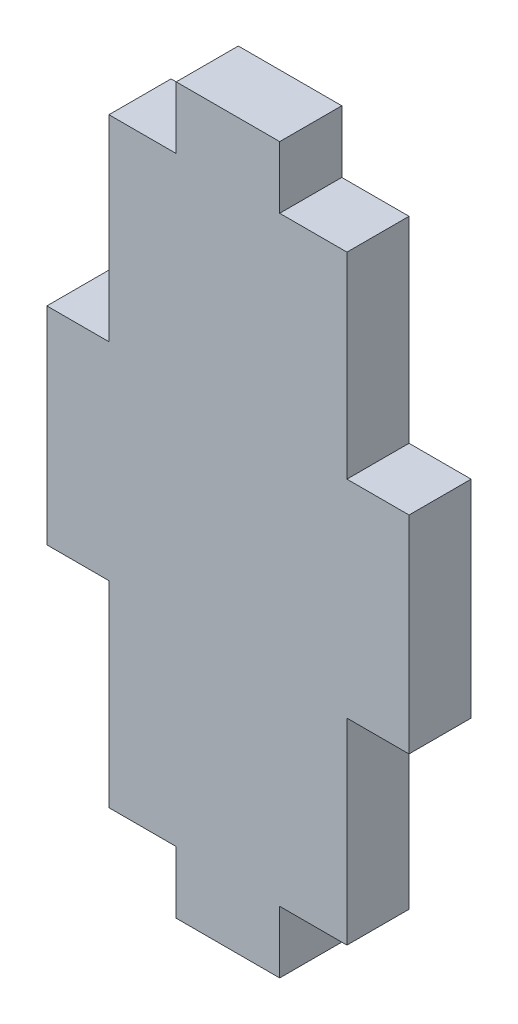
from build123d import *

# Parameters (mm, degrees)
CROQUIS1_W                 = 17.5
CROQUIS1_H                 = 35
SALIENTE_EXTRUIR1_DEPTH    = 3
CORTAR_EXTRUIR4_DEPTH      = 126.308667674
CORTAR_EXTRUIR4_DEPTH_BACK = 126.308667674


with BuildPart() as part:
    # Croquis1 → Saliente-Extruir1 (new body)
    with BuildSketch(Plane.XY):
        with Locations((53.907728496, 53.902222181)):
            Rectangle(CROQUIS1_W, CROQUIS1_H)
    extrude(amount=SALIENTE_EXTRUIR1_DEPTH)

    # Croquis5 → Cortar-Extruir4 (cut, two sides: drawn at the far end of the back side and taken through both)
    with BuildSketch(Plane(origin=(162.657728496, 79.841975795, 0), x_dir=(1, 0, 0), z_dir=(0, 0, -1)).offset(-CORTAR_EXTRUIR4_DEPTH_BACK)):
        Polygon((-106.25, 8.439753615), (-103, 8.439753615), (-100, 8.439753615), (-100, 20.939753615), (-103, 20.939753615), (-103, 11.439753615), (-106.25, 11.439753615), align=None)
        Polygon((-114.5, 20.939753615), (-117.5, 20.939753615), (-117.5, 8.439753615), (-114.5, 8.439753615), (-111.25, 8.439753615), (-111.25, 11.439753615), (-114.5, 11.439753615), align=None)
        Polygon((-111.25, 43.439753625), (-111.25, 40.439753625), (-114.5, 40.439753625), (-114.5, 30.939753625), (-117.5, 30.939753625), (-117.5, 43.439753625), (-114.5, 43.439753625), align=None)
        Polygon((-100, 43.439753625), (-100, 30.939753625), (-103, 30.939753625), (-103, 40.439753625), (-106.25, 40.439753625), (-106.25, 43.439753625), (-103, 43.439753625), align=None)
    extrude(amount=CORTAR_EXTRUIR4_DEPTH + CORTAR_EXTRUIR4_DEPTH_BACK, mode=Mode.SUBTRACT)


solid = part.part
